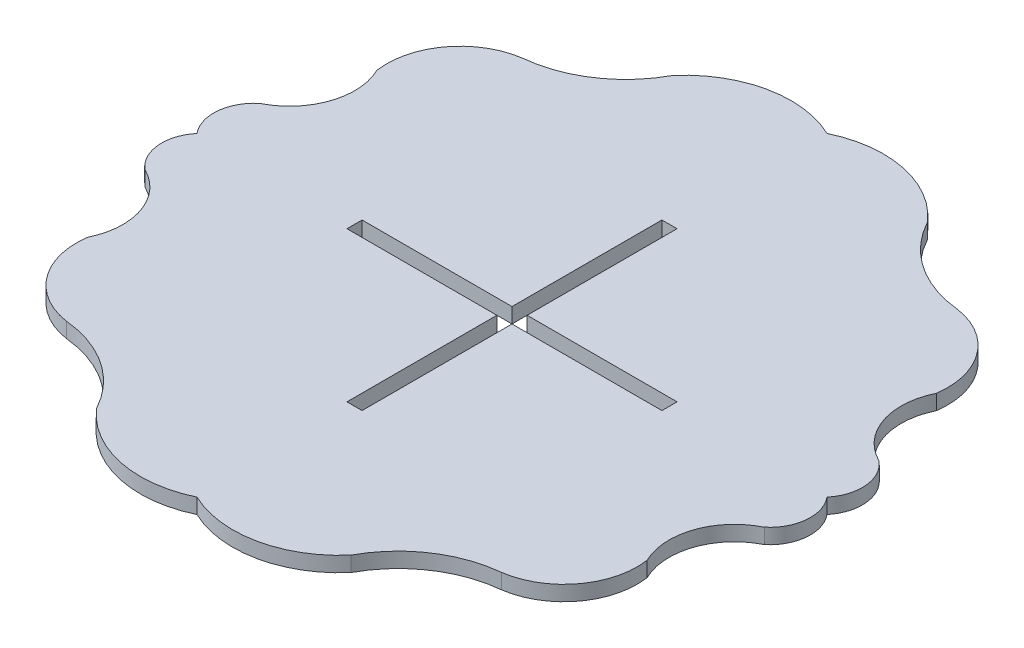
ISO-10303-21;
HEADER;
FILE_DESCRIPTION(('STEP AP214'),'2;1');
FILE_NAME('part.step','',(''),(''),'','','');
FILE_SCHEMA(('AUTOMOTIVE_DESIGN { 1 0 10303 214 1 1 1 1 }'));
ENDSEC;
DATA;
#1=APPLICATION_CONTEXT('core data for automotive mechanical design processes');
#2=APPLICATION_PROTOCOL_DEFINITION('international standard','automotive_design',2000,#1);
#3=PRODUCT_CONTEXT('',#1,'mechanical');
#4=PRODUCT('Part','Part','',(#3));
#5=PRODUCT_RELATED_PRODUCT_CATEGORY('part','',(#4));
#6=PRODUCT_DEFINITION_FORMATION('','',#4);
#7=PRODUCT_DEFINITION_CONTEXT('part definition',#1,'design');
#8=PRODUCT_DEFINITION('design','',#6,#7);
#9=PRODUCT_DEFINITION_SHAPE('','',#8);
#10=(LENGTH_UNIT() NAMED_UNIT(*) SI_UNIT(.MILLI.,.METRE.));
#11=(NAMED_UNIT(*) PLANE_ANGLE_UNIT() SI_UNIT($,.RADIAN.));
#12=(NAMED_UNIT(*) SI_UNIT($,.STERADIAN.) SOLID_ANGLE_UNIT());
#13=UNCERTAINTY_MEASURE_WITH_UNIT(LENGTH_MEASURE(1.E-05),#10,'distance_accuracy_value','');
#14=(GEOMETRIC_REPRESENTATION_CONTEXT(3) GLOBAL_UNCERTAINTY_ASSIGNED_CONTEXT((#13)) GLOBAL_UNIT_ASSIGNED_CONTEXT((#10,
#11,#12)) REPRESENTATION_CONTEXT('',''));
#15=CARTESIAN_POINT('',(0.,0.,0.));
#16=DIRECTION('',(0.,0.,1.));
#17=DIRECTION('',(1.,0.,0.));
#18=AXIS2_PLACEMENT_3D('',#15,#16,#17);
#19=CARTESIAN_POINT('',(109.076640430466,12.,-222.7049080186));
#20=DIRECTION('',(0.,-1.,0.));
#21=DIRECTION('',(0.,0.,-1.));
#22=AXIS2_PLACEMENT_3D('',#19,#20,#21);
#23=PLANE('',#22);
#24=CARTESIAN_POINT('',(36.6461026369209,12.,-173.651286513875));
#25=DIRECTION('',(0.,1.,0.));
#26=DIRECTION('',(0.,0.,-1.));
#27=AXIS2_PLACEMENT_3D('',#24,#25,#26);
#28=CIRCLE('',#27,84.6880327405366);
#29=CARTESIAN_POINT('',(101.017560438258,12.,-228.681989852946));
#30=VERTEX_POINT('',#29);
#31=CARTESIAN_POINT('',(0.,12.,-250.));
#32=VERTEX_POINT('',#31);
#33=EDGE_CURVE('E335',#30,#32,#28,.T.);
#34=ORIENTED_EDGE('',*,*,#33,.T.);
#35=CARTESIAN_POINT('',(-36.6461026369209,12.,-173.651286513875));
#36=DIRECTION('',(0.,1.,0.));
#37=DIRECTION('',(0.,0.,1.));
#38=AXIS2_PLACEMENT_3D('',#35,#36,#37);
#39=CIRCLE('',#38,84.6880327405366);
#40=CARTESIAN_POINT('',(-101.017560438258,12.,-228.681989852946));
#41=VERTEX_POINT('',#40);
#42=EDGE_CURVE('E338',#32,#41,#39,.T.);
#43=ORIENTED_EDGE('',*,*,#42,.T.);
#44=CARTESIAN_POINT('',(-181.50717822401,12.,-271.758529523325));
#45=DIRECTION('',(0.,-1.,0.));
#46=DIRECTION('',(0.,0.,-1.));
#47=AXIS2_PLACEMENT_3D('',#44,#45,#46);
#48=CIRCLE('',#47,91.2916581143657);
#49=CARTESIAN_POINT('',(-172.546852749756,12.,-180.907665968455));
#50=VERTEX_POINT('',#49);
#51=EDGE_CURVE('E341',#41,#50,#48,.T.);
#52=ORIENTED_EDGE('',*,*,#51,.T.);
#53=CARTESIAN_POINT('',(-164.277818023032,12.,-123.137833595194));
#54=DIRECTION('',(0.,1.,0.));
#55=DIRECTION('',(0.,0.,1.));
#56=AXIS2_PLACEMENT_3D('',#53,#54,#55);
#57=CIRCLE('',#56,58.358636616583);
#58=CARTESIAN_POINT('',(-222.047650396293,12.,-114.868798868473));
#59=VERTEX_POINT('',#58);
#60=EDGE_CURVE('E343',#50,#59,#57,.T.);
#61=ORIENTED_EDGE('',*,*,#60,.T.);
#62=CARTESIAN_POINT('',(-268.615396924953,12.,-92.0764276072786));
#63=DIRECTION('',(0.,-1.,0.));
#64=DIRECTION('',(0.,0.,-1.));
#65=AXIS2_PLACEMENT_3D('',#62,#63,#64);
#66=CIRCLE('',#65,51.8463808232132);
#67=CARTESIAN_POINT('',(-245.823025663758,12.,-45.5086810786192));
#68=VERTEX_POINT('',#67);
#69=EDGE_CURVE('E345',#59,#68,#66,.T.);
#70=ORIENTED_EDGE('',*,*,#69,.T.);
#71=CARTESIAN_POINT('',(-225.157172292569,12.,-20.6658533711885));
#72=DIRECTION('',(0.,1.,0.));
#73=DIRECTION('',(0.,0.,1.));
#74=AXIS2_PLACEMENT_3D('',#71,#72,#73);
#75=CIRCLE('',#74,32.3147579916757);
#76=CARTESIAN_POINT('',(-250.,12.,0.));
#77=VERTEX_POINT('',#76);
#78=EDGE_CURVE('E347',#68,#77,#75,.T.);
#79=ORIENTED_EDGE('',*,*,#78,.T.);
#80=CARTESIAN_POINT('',(-225.157172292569,12.,20.6658533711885));
#81=DIRECTION('',(0.,1.,0.));
#82=DIRECTION('',(0.,0.,-1.));
#83=AXIS2_PLACEMENT_3D('',#80,#81,#82);
#84=CIRCLE('',#83,32.3147579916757);
#85=CARTESIAN_POINT('',(-245.823025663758,12.,45.5086810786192));
#86=VERTEX_POINT('',#85);
#87=EDGE_CURVE('E349',#77,#86,#84,.T.);
#88=ORIENTED_EDGE('',*,*,#87,.T.);
#89=CARTESIAN_POINT('',(-268.615396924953,12.,92.0764276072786));
#90=DIRECTION('',(0.,-1.,0.));
#91=DIRECTION('',(0.,0.,1.));
#92=AXIS2_PLACEMENT_3D('',#89,#90,#91);
#93=CIRCLE('',#92,51.8463808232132);
#94=CARTESIAN_POINT('',(-222.047650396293,12.,114.868798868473));
#95=VERTEX_POINT('',#94);
#96=EDGE_CURVE('E351',#86,#95,#93,.T.);
#97=ORIENTED_EDGE('',*,*,#96,.T.);
#98=CARTESIAN_POINT('',(-164.277818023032,12.,123.137833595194));
#99=DIRECTION('',(0.,1.,0.));
#100=DIRECTION('',(0.,0.,-1.));
#101=AXIS2_PLACEMENT_3D('',#98,#99,#100);
#102=CIRCLE('',#101,58.358636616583);
#103=CARTESIAN_POINT('',(-172.546852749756,12.,180.907665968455));
#104=VERTEX_POINT('',#103);
#105=EDGE_CURVE('E353',#95,#104,#102,.T.);
#106=ORIENTED_EDGE('',*,*,#105,.T.);
#107=CARTESIAN_POINT('',(-181.50717822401,12.,271.758529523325));
#108=DIRECTION('',(0.,-1.,0.));
#109=DIRECTION('',(0.,0.,1.));
#110=AXIS2_PLACEMENT_3D('',#107,#108,#109);
#111=CIRCLE('',#110,91.2916581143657);
#112=CARTESIAN_POINT('',(-101.017560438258,12.,228.681989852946));
#113=VERTEX_POINT('',#112);
#114=EDGE_CURVE('E355',#104,#113,#111,.T.);
#115=ORIENTED_EDGE('',*,*,#114,.T.);
#116=CARTESIAN_POINT('',(-36.6461026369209,12.,173.651286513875));
#117=DIRECTION('',(0.,1.,0.));
#118=DIRECTION('',(0.,0.,-1.));
#119=AXIS2_PLACEMENT_3D('',#116,#117,#118);
#120=CIRCLE('',#119,84.6880327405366);
#121=CARTESIAN_POINT('',(0.,12.,250.));
#122=VERTEX_POINT('',#121);
#123=EDGE_CURVE('E357',#113,#122,#120,.T.);
#124=ORIENTED_EDGE('',*,*,#123,.T.);
#125=CARTESIAN_POINT('',(36.6461026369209,12.,173.651286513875));
#126=DIRECTION('',(0.,1.,0.));
#127=DIRECTION('',(0.,0.,1.));
#128=AXIS2_PLACEMENT_3D('',#125,#126,#127);
#129=CIRCLE('',#128,84.6880327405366);
#130=CARTESIAN_POINT('',(101.017560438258,12.,228.681989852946));
#131=VERTEX_POINT('',#130);
#132=EDGE_CURVE('E359',#122,#131,#129,.T.);
#133=ORIENTED_EDGE('',*,*,#132,.T.);
#134=CARTESIAN_POINT('',(181.50717822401,12.,271.758529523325));
#135=DIRECTION('',(0.,-1.,0.));
#136=DIRECTION('',(0.,0.,-1.));
#137=AXIS2_PLACEMENT_3D('',#134,#135,#136);
#138=CIRCLE('',#137,91.2916581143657);
#139=CARTESIAN_POINT('',(172.546852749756,12.,180.907665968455));
#140=VERTEX_POINT('',#139);
#141=EDGE_CURVE('E361',#131,#140,#138,.T.);
#142=ORIENTED_EDGE('',*,*,#141,.T.);
#143=CARTESIAN_POINT('',(164.277818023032,12.,123.137833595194));
#144=DIRECTION('',(0.,1.,0.));
#145=DIRECTION('',(0.,0.,1.));
#146=AXIS2_PLACEMENT_3D('',#143,#144,#145);
#147=CIRCLE('',#146,58.358636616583);
#148=CARTESIAN_POINT('',(222.047650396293,12.,114.868798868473));
#149=VERTEX_POINT('',#148);
#150=EDGE_CURVE('E363',#140,#149,#147,.T.);
#151=ORIENTED_EDGE('',*,*,#150,.T.);
#152=CARTESIAN_POINT('',(268.615396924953,12.,92.0764276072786));
#153=DIRECTION('',(0.,-1.,0.));
#154=DIRECTION('',(0.,0.,-1.));
#155=AXIS2_PLACEMENT_3D('',#152,#153,#154);
#156=CIRCLE('',#155,51.8463808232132);
#157=CARTESIAN_POINT('',(245.823025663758,12.,45.5086810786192));
#158=VERTEX_POINT('',#157);
#159=EDGE_CURVE('E365',#149,#158,#156,.T.);
#160=ORIENTED_EDGE('',*,*,#159,.T.);
#161=CARTESIAN_POINT('',(225.157172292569,12.,20.6658533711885));
#162=DIRECTION('',(0.,1.,0.));
#163=DIRECTION('',(0.,0.,1.));
#164=AXIS2_PLACEMENT_3D('',#161,#162,#163);
#165=CIRCLE('',#164,32.3147579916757);
#166=CARTESIAN_POINT('',(250.,12.,0.));
#167=VERTEX_POINT('',#166);
#168=EDGE_CURVE('E367',#158,#167,#165,.T.);
#169=ORIENTED_EDGE('',*,*,#168,.T.);
#170=CARTESIAN_POINT('',(225.157172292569,12.,-20.6658533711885));
#171=DIRECTION('',(0.,1.,0.));
#172=DIRECTION('',(0.,0.,-1.));
#173=AXIS2_PLACEMENT_3D('',#170,#171,#172);
#174=CIRCLE('',#173,32.3147579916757);
#175=CARTESIAN_POINT('',(245.823025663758,12.,-45.5086810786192));
#176=VERTEX_POINT('',#175);
#177=EDGE_CURVE('E369',#167,#176,#174,.T.);
#178=ORIENTED_EDGE('',*,*,#177,.T.);
#179=CARTESIAN_POINT('',(268.615396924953,12.,-92.0764276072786));
#180=DIRECTION('',(0.,-1.,0.));
#181=DIRECTION('',(0.,0.,1.));
#182=AXIS2_PLACEMENT_3D('',#179,#180,#181);
#183=CIRCLE('',#182,51.8463808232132);
#184=CARTESIAN_POINT('',(222.047650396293,12.,-114.868798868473));
#185=VERTEX_POINT('',#184);
#186=EDGE_CURVE('E371',#176,#185,#183,.T.);
#187=ORIENTED_EDGE('',*,*,#186,.T.);
#188=CARTESIAN_POINT('',(164.277818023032,12.,-123.137833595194));
#189=DIRECTION('',(0.,1.,0.));
#190=DIRECTION('',(0.,0.,-1.));
#191=AXIS2_PLACEMENT_3D('',#188,#189,#190);
#192=CIRCLE('',#191,58.358636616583);
#193=CARTESIAN_POINT('',(172.546852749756,12.,-180.907665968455));
#194=VERTEX_POINT('',#193);
#195=EDGE_CURVE('E373',#185,#194,#192,.T.);
#196=ORIENTED_EDGE('',*,*,#195,.T.);
#197=CARTESIAN_POINT('',(181.50717822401,12.,-271.758529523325));
#198=DIRECTION('',(0.,-1.,0.));
#199=DIRECTION('',(0.,0.,1.));
#200=AXIS2_PLACEMENT_3D('',#197,#198,#199);
#201=CIRCLE('',#200,91.2916581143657);
#202=EDGE_CURVE('E375',#194,#30,#201,.T.);
#203=ORIENTED_EDGE('',*,*,#202,.T.);
#204=EDGE_LOOP('',(#34,#43,#52,#61,#70,#79,#88,#97,#106,#115,#124,#133,#142,#151,#160,#169,#178,
#187,#196,#203));
#205=FACE_BOUND('',#204,.T.);
#206=DIRECTION('',(0.,0.,1.));
#207=VECTOR('',#206,1.);
#208=CARTESIAN_POINT('',(-5.99999999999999,12.,-125.));
#209=LINE('',#208,#207);
#210=CARTESIAN_POINT('',(-5.99999999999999,12.,-125.));
#211=VERTEX_POINT('',#210);
#212=CARTESIAN_POINT('',(-5.99999999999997,12.,-6.));
#213=VERTEX_POINT('',#212);
#214=EDGE_CURVE('E242',#211,#213,#209,.T.);
#215=ORIENTED_EDGE('',*,*,#214,.F.);
#216=DIRECTION('',(-1.,0.,0.));
#217=VECTOR('',#216,1.);
#218=CARTESIAN_POINT('',(-5.99999999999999,12.,-125.));
#219=LINE('',#218,#217);
#220=CARTESIAN_POINT('',(6.00000000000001,12.,-125.));
#221=VERTEX_POINT('',#220);
#222=EDGE_CURVE('E283',#221,#211,#219,.T.);
#223=ORIENTED_EDGE('',*,*,#222,.F.);
#224=DIRECTION('',(0.,0.,-1.));
#225=VECTOR('',#224,1.);
#226=CARTESIAN_POINT('',(6.00000000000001,12.,-125.));
#227=LINE('',#226,#225);
#228=CARTESIAN_POINT('',(6.00000000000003,12.,-6.));
#229=VERTEX_POINT('',#228);
#230=EDGE_CURVE('E281',#229,#221,#227,.T.);
#231=ORIENTED_EDGE('',*,*,#230,.F.);
#232=DIRECTION('',(-1.,0.,0.));
#233=VECTOR('',#232,1.);
#234=CARTESIAN_POINT('',(6.00000000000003,12.,-6.));
#235=LINE('',#234,#233);
#236=CARTESIAN_POINT('',(125.,12.,-6.));
#237=VERTEX_POINT('',#236);
#238=EDGE_CURVE('E279',#237,#229,#235,.T.);
#239=ORIENTED_EDGE('',*,*,#238,.F.);
#240=DIRECTION('',(0.,0.,-1.));
#241=VECTOR('',#240,1.);
#242=CARTESIAN_POINT('',(125.,12.,-6.));
#243=LINE('',#242,#241);
#244=CARTESIAN_POINT('',(125.,12.,6.));
#245=VERTEX_POINT('',#244);
#246=EDGE_CURVE('E277',#245,#237,#243,.T.);
#247=ORIENTED_EDGE('',*,*,#246,.F.);
#248=DIRECTION('',(1.,0.,0.));
#249=VECTOR('',#248,1.);
#250=CARTESIAN_POINT('',(6.00000000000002,12.,6.));
#251=LINE('',#250,#249);
#252=CARTESIAN_POINT('',(6.00000000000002,12.,6.));
#253=VERTEX_POINT('',#252);
#254=EDGE_CURVE('E275',#253,#245,#251,.T.);
#255=ORIENTED_EDGE('',*,*,#254,.F.);
#256=DIRECTION('',(0.,0.,-1.));
#257=VECTOR('',#256,1.);
#258=CARTESIAN_POINT('',(6.00000000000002,12.,6.));
#259=LINE('',#258,#257);
#260=CARTESIAN_POINT('',(6.00000000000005,12.,125.));
#261=VERTEX_POINT('',#260);
#262=EDGE_CURVE('E273',#261,#253,#259,.T.);
#263=ORIENTED_EDGE('',*,*,#262,.F.);
#264=DIRECTION('',(1.,0.,0.));
#265=VECTOR('',#264,1.);
#266=CARTESIAN_POINT('',(-5.99999999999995,12.,125.));
#267=LINE('',#266,#265);
#268=CARTESIAN_POINT('',(-5.99999999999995,12.,125.));
#269=VERTEX_POINT('',#268);
#270=EDGE_CURVE('E271',#269,#261,#267,.T.);
#271=ORIENTED_EDGE('',*,*,#270,.F.);
#272=DIRECTION('',(0.,0.,1.));
#273=VECTOR('',#272,1.);
#274=CARTESIAN_POINT('',(-5.99999999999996,12.,6.));
#275=LINE('',#274,#273);
#276=CARTESIAN_POINT('',(-5.99999999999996,12.,6.));
#277=VERTEX_POINT('',#276);
#278=EDGE_CURVE('E269',#277,#269,#275,.T.);
#279=ORIENTED_EDGE('',*,*,#278,.F.);
#280=DIRECTION('',(1.,0.,0.));
#281=VECTOR('',#280,1.);
#282=CARTESIAN_POINT('',(-125.,12.,6.));
#283=LINE('',#282,#281);
#284=CARTESIAN_POINT('',(-125.,12.,6.));
#285=VERTEX_POINT('',#284);
#286=EDGE_CURVE('E265',#285,#277,#283,.T.);
#287=ORIENTED_EDGE('',*,*,#286,.F.);
#288=DIRECTION('',(0.,0.,1.));
#289=VECTOR('',#288,1.);
#290=CARTESIAN_POINT('',(-125.,12.,-6.));
#291=LINE('',#290,#289);
#292=CARTESIAN_POINT('',(-125.,12.,-6.));
#293=VERTEX_POINT('',#292);
#294=EDGE_CURVE('E263',#293,#285,#291,.T.);
#295=ORIENTED_EDGE('',*,*,#294,.F.);
#296=DIRECTION('',(-1.,0.,0.));
#297=VECTOR('',#296,1.);
#298=CARTESIAN_POINT('',(-125.,12.,-6.));
#299=LINE('',#298,#297);
#300=EDGE_CURVE('E250',#213,#293,#299,.T.);
#301=ORIENTED_EDGE('',*,*,#300,.F.);
#302=EDGE_LOOP('',(#215,#223,#231,#239,#247,#255,#263,#271,#279,#287,#295,#301));
#303=FACE_BOUND('',#302,.T.);
#304=ADVANCED_FACE('F33',(#205,#303),#23,.F.);
#305=CARTESIAN_POINT('',(109.076640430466,0.,-222.7049080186));
#306=DIRECTION('',(0.,-1.,0.));
#307=DIRECTION('',(0.,0.,-1.));
#308=AXIS2_PLACEMENT_3D('',#305,#306,#307);
#309=PLANE('',#308);
#310=CARTESIAN_POINT('',(36.6461026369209,0.,-173.651286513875));
#311=DIRECTION('',(0.,1.,0.));
#312=DIRECTION('',(0.,0.,-1.));
#313=AXIS2_PLACEMENT_3D('',#310,#311,#312);
#314=CIRCLE('',#313,84.6880327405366);
#315=CARTESIAN_POINT('',(101.017560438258,0.,-228.681989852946));
#316=VERTEX_POINT('',#315);
#317=CARTESIAN_POINT('',(0.,0.,-250.));
#318=VERTEX_POINT('',#317);
#319=EDGE_CURVE('E258',#316,#318,#314,.T.);
#320=ORIENTED_EDGE('',*,*,#319,.F.);
#321=CARTESIAN_POINT('',(181.50717822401,0.,-271.758529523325));
#322=DIRECTION('',(0.,-1.,0.));
#323=DIRECTION('',(0.,0.,1.));
#324=AXIS2_PLACEMENT_3D('',#321,#322,#323);
#325=CIRCLE('',#324,91.2916581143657);
#326=CARTESIAN_POINT('',(172.546852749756,0.,-180.907665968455));
#327=VERTEX_POINT('',#326);
#328=EDGE_CURVE('E339',#327,#316,#325,.T.);
#329=ORIENTED_EDGE('',*,*,#328,.F.);
#330=CARTESIAN_POINT('',(164.277818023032,0.,-123.137833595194));
#331=DIRECTION('',(0.,1.,0.));
#332=DIRECTION('',(0.,0.,-1.));
#333=AXIS2_PLACEMENT_3D('',#330,#331,#332);
#334=CIRCLE('',#333,58.358636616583);
#335=CARTESIAN_POINT('',(222.047650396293,0.,-114.868798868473));
#336=VERTEX_POINT('',#335);
#337=EDGE_CURVE('E414',#336,#327,#334,.T.);
#338=ORIENTED_EDGE('',*,*,#337,.F.);
#339=CARTESIAN_POINT('',(268.615396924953,0.,-92.0764276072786));
#340=DIRECTION('',(0.,-1.,0.));
#341=DIRECTION('',(0.,0.,1.));
#342=AXIS2_PLACEMENT_3D('',#339,#340,#341);
#343=CIRCLE('',#342,51.8463808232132);
#344=CARTESIAN_POINT('',(245.823025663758,0.,-45.5086810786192));
#345=VERTEX_POINT('',#344);
#346=EDGE_CURVE('E412',#345,#336,#343,.T.);
#347=ORIENTED_EDGE('',*,*,#346,.F.);
#348=CARTESIAN_POINT('',(225.157172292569,0.,-20.6658533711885));
#349=DIRECTION('',(0.,1.,0.));
#350=DIRECTION('',(0.,0.,-1.));
#351=AXIS2_PLACEMENT_3D('',#348,#349,#350);
#352=CIRCLE('',#351,32.3147579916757);
#353=CARTESIAN_POINT('',(250.,0.,0.));
#354=VERTEX_POINT('',#353);
#355=EDGE_CURVE('E410',#354,#345,#352,.T.);
#356=ORIENTED_EDGE('',*,*,#355,.F.);
#357=CARTESIAN_POINT('',(225.157172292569,0.,20.6658533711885));
#358=DIRECTION('',(0.,1.,0.));
#359=DIRECTION('',(0.,0.,1.));
#360=AXIS2_PLACEMENT_3D('',#357,#358,#359);
#361=CIRCLE('',#360,32.3147579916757);
#362=CARTESIAN_POINT('',(245.823025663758,0.,45.5086810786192));
#363=VERTEX_POINT('',#362);
#364=EDGE_CURVE('E408',#363,#354,#361,.T.);
#365=ORIENTED_EDGE('',*,*,#364,.F.);
#366=CARTESIAN_POINT('',(268.615396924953,0.,92.0764276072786));
#367=DIRECTION('',(0.,-1.,0.));
#368=DIRECTION('',(0.,0.,-1.));
#369=AXIS2_PLACEMENT_3D('',#366,#367,#368);
#370=CIRCLE('',#369,51.8463808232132);
#371=CARTESIAN_POINT('',(222.047650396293,0.,114.868798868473));
#372=VERTEX_POINT('',#371);
#373=EDGE_CURVE('E406',#372,#363,#370,.T.);
#374=ORIENTED_EDGE('',*,*,#373,.F.);
#375=CARTESIAN_POINT('',(164.277818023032,0.,123.137833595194));
#376=DIRECTION('',(0.,1.,0.));
#377=DIRECTION('',(0.,0.,1.));
#378=AXIS2_PLACEMENT_3D('',#375,#376,#377);
#379=CIRCLE('',#378,58.358636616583);
#380=CARTESIAN_POINT('',(172.546852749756,0.,180.907665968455));
#381=VERTEX_POINT('',#380);
#382=EDGE_CURVE('E404',#381,#372,#379,.T.);
#383=ORIENTED_EDGE('',*,*,#382,.F.);
#384=CARTESIAN_POINT('',(181.50717822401,0.,271.758529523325));
#385=DIRECTION('',(0.,-1.,0.));
#386=DIRECTION('',(0.,0.,-1.));
#387=AXIS2_PLACEMENT_3D('',#384,#385,#386);
#388=CIRCLE('',#387,91.2916581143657);
#389=CARTESIAN_POINT('',(101.017560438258,0.,228.681989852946));
#390=VERTEX_POINT('',#389);
#391=EDGE_CURVE('E402',#390,#381,#388,.T.);
#392=ORIENTED_EDGE('',*,*,#391,.F.);
#393=CARTESIAN_POINT('',(36.6461026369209,0.,173.651286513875));
#394=DIRECTION('',(0.,1.,0.));
#395=DIRECTION('',(0.,0.,1.));
#396=AXIS2_PLACEMENT_3D('',#393,#394,#395);
#397=CIRCLE('',#396,84.6880327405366);
#398=CARTESIAN_POINT('',(0.,0.,250.));
#399=VERTEX_POINT('',#398);
#400=EDGE_CURVE('E400',#399,#390,#397,.T.);
#401=ORIENTED_EDGE('',*,*,#400,.F.);
#402=CARTESIAN_POINT('',(-36.6461026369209,0.,173.651286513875));
#403=DIRECTION('',(0.,1.,0.));
#404=DIRECTION('',(0.,0.,-1.));
#405=AXIS2_PLACEMENT_3D('',#402,#403,#404);
#406=CIRCLE('',#405,84.6880327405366);
#407=CARTESIAN_POINT('',(-101.017560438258,0.,228.681989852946));
#408=VERTEX_POINT('',#407);
#409=EDGE_CURVE('E398',#408,#399,#406,.T.);
#410=ORIENTED_EDGE('',*,*,#409,.F.);
#411=CARTESIAN_POINT('',(-181.50717822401,0.,271.758529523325));
#412=DIRECTION('',(0.,-1.,0.));
#413=DIRECTION('',(0.,0.,1.));
#414=AXIS2_PLACEMENT_3D('',#411,#412,#413);
#415=CIRCLE('',#414,91.2916581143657);
#416=CARTESIAN_POINT('',(-172.546852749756,0.,180.907665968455));
#417=VERTEX_POINT('',#416);
#418=EDGE_CURVE('E396',#417,#408,#415,.T.);
#419=ORIENTED_EDGE('',*,*,#418,.F.);
#420=CARTESIAN_POINT('',(-164.277818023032,0.,123.137833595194));
#421=DIRECTION('',(0.,1.,0.));
#422=DIRECTION('',(0.,0.,-1.));
#423=AXIS2_PLACEMENT_3D('',#420,#421,#422);
#424=CIRCLE('',#423,58.358636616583);
#425=CARTESIAN_POINT('',(-222.047650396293,0.,114.868798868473));
#426=VERTEX_POINT('',#425);
#427=EDGE_CURVE('E394',#426,#417,#424,.T.);
#428=ORIENTED_EDGE('',*,*,#427,.F.);
#429=CARTESIAN_POINT('',(-268.615396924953,0.,92.0764276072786));
#430=DIRECTION('',(0.,-1.,0.));
#431=DIRECTION('',(0.,0.,1.));
#432=AXIS2_PLACEMENT_3D('',#429,#430,#431);
#433=CIRCLE('',#432,51.8463808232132);
#434=CARTESIAN_POINT('',(-245.823025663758,0.,45.5086810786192));
#435=VERTEX_POINT('',#434);
#436=EDGE_CURVE('E392',#435,#426,#433,.T.);
#437=ORIENTED_EDGE('',*,*,#436,.F.);
#438=CARTESIAN_POINT('',(-225.157172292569,0.,20.6658533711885));
#439=DIRECTION('',(0.,1.,0.));
#440=DIRECTION('',(0.,0.,-1.));
#441=AXIS2_PLACEMENT_3D('',#438,#439,#440);
#442=CIRCLE('',#441,32.3147579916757);
#443=CARTESIAN_POINT('',(-250.,0.,0.));
#444=VERTEX_POINT('',#443);
#445=EDGE_CURVE('E390',#444,#435,#442,.T.);
#446=ORIENTED_EDGE('',*,*,#445,.F.);
#447=CARTESIAN_POINT('',(-225.157172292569,0.,-20.6658533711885));
#448=DIRECTION('',(0.,1.,0.));
#449=DIRECTION('',(0.,0.,1.));
#450=AXIS2_PLACEMENT_3D('',#447,#448,#449);
#451=CIRCLE('',#450,32.3147579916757);
#452=CARTESIAN_POINT('',(-245.823025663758,0.,-45.5086810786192));
#453=VERTEX_POINT('',#452);
#454=EDGE_CURVE('E388',#453,#444,#451,.T.);
#455=ORIENTED_EDGE('',*,*,#454,.F.);
#456=CARTESIAN_POINT('',(-268.615396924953,0.,-92.0764276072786));
#457=DIRECTION('',(0.,-1.,0.));
#458=DIRECTION('',(0.,0.,-1.));
#459=AXIS2_PLACEMENT_3D('',#456,#457,#458);
#460=CIRCLE('',#459,51.8463808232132);
#461=CARTESIAN_POINT('',(-222.047650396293,0.,-114.868798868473));
#462=VERTEX_POINT('',#461);
#463=EDGE_CURVE('E386',#462,#453,#460,.T.);
#464=ORIENTED_EDGE('',*,*,#463,.F.);
#465=CARTESIAN_POINT('',(-164.277818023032,0.,-123.137833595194));
#466=DIRECTION('',(0.,1.,0.));
#467=DIRECTION('',(0.,0.,1.));
#468=AXIS2_PLACEMENT_3D('',#465,#466,#467);
#469=CIRCLE('',#468,58.358636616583);
#470=CARTESIAN_POINT('',(-172.546852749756,0.,-180.907665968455));
#471=VERTEX_POINT('',#470);
#472=EDGE_CURVE('E384',#471,#462,#469,.T.);
#473=ORIENTED_EDGE('',*,*,#472,.F.);
#474=CARTESIAN_POINT('',(-181.50717822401,0.,-271.758529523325));
#475=DIRECTION('',(0.,-1.,0.));
#476=DIRECTION('',(0.,0.,-1.));
#477=AXIS2_PLACEMENT_3D('',#474,#475,#476);
#478=CIRCLE('',#477,91.2916581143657);
#479=CARTESIAN_POINT('',(-101.017560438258,0.,-228.681989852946));
#480=VERTEX_POINT('',#479);
#481=EDGE_CURVE('E382',#480,#471,#478,.T.);
#482=ORIENTED_EDGE('',*,*,#481,.F.);
#483=CARTESIAN_POINT('',(-36.6461026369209,0.,-173.651286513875));
#484=DIRECTION('',(0.,1.,0.));
#485=DIRECTION('',(0.,0.,1.));
#486=AXIS2_PLACEMENT_3D('',#483,#484,#485);
#487=CIRCLE('',#486,84.6880327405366);
#488=EDGE_CURVE('E380',#318,#480,#487,.T.);
#489=ORIENTED_EDGE('',*,*,#488,.F.);
#490=EDGE_LOOP('',(#320,#329,#338,#347,#356,#365,#374,#383,#392,#401,#410,#419,#428,#437,#446,
#455,#464,#473,#482,#489));
#491=FACE_BOUND('',#490,.T.);
#492=DIRECTION('',(-1.,0.,0.));
#493=VECTOR('',#492,1.);
#494=CARTESIAN_POINT('',(-5.99999999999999,0.,-125.));
#495=LINE('',#494,#493);
#496=CARTESIAN_POINT('',(6.00000000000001,0.,-125.));
#497=VERTEX_POINT('',#496);
#498=CARTESIAN_POINT('',(-5.99999999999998,0.,-125.));
#499=VERTEX_POINT('',#498);
#500=EDGE_CURVE('E251',#497,#499,#495,.T.);
#501=ORIENTED_EDGE('',*,*,#500,.T.);
#502=DIRECTION('',(0.,0.,1.));
#503=VECTOR('',#502,1.);
#504=CARTESIAN_POINT('',(-5.99999999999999,0.,-125.));
#505=LINE('',#504,#503);
#506=CARTESIAN_POINT('',(-5.99999999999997,0.,-6.));
#507=VERTEX_POINT('',#506);
#508=EDGE_CURVE('E56',#499,#507,#505,.T.);
#509=ORIENTED_EDGE('',*,*,#508,.T.);
#510=DIRECTION('',(-1.,0.,0.));
#511=VECTOR('',#510,1.);
#512=CARTESIAN_POINT('',(-125.,0.,-6.));
#513=LINE('',#512,#511);
#514=CARTESIAN_POINT('',(-125.,0.,-6.));
#515=VERTEX_POINT('',#514);
#516=EDGE_CURVE('E257',#507,#515,#513,.T.);
#517=ORIENTED_EDGE('',*,*,#516,.T.);
#518=DIRECTION('',(0.,0.,1.));
#519=VECTOR('',#518,1.);
#520=CARTESIAN_POINT('',(-125.,0.,-6.));
#521=LINE('',#520,#519);
#522=CARTESIAN_POINT('',(-125.,0.,6.));
#523=VERTEX_POINT('',#522);
#524=EDGE_CURVE('E287',#515,#523,#521,.T.);
#525=ORIENTED_EDGE('',*,*,#524,.T.);
#526=DIRECTION('',(1.,0.,0.));
#527=VECTOR('',#526,1.);
#528=CARTESIAN_POINT('',(-125.,0.,6.));
#529=LINE('',#528,#527);
#530=CARTESIAN_POINT('',(-5.99999999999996,0.,6.));
#531=VERTEX_POINT('',#530);
#532=EDGE_CURVE('E290',#523,#531,#529,.T.);
#533=ORIENTED_EDGE('',*,*,#532,.T.);
#534=DIRECTION('',(0.,0.,1.));
#535=VECTOR('',#534,1.);
#536=CARTESIAN_POINT('',(-5.99999999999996,0.,6.));
#537=LINE('',#536,#535);
#538=CARTESIAN_POINT('',(-5.99999999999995,0.,125.));
#539=VERTEX_POINT('',#538);
#540=EDGE_CURVE('E293',#531,#539,#537,.T.);
#541=ORIENTED_EDGE('',*,*,#540,.T.);
#542=DIRECTION('',(1.,0.,0.));
#543=VECTOR('',#542,1.);
#544=CARTESIAN_POINT('',(-5.99999999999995,0.,125.));
#545=LINE('',#544,#543);
#546=CARTESIAN_POINT('',(6.00000000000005,0.,125.));
#547=VERTEX_POINT('',#546);
#548=EDGE_CURVE('E296',#539,#547,#545,.T.);
#549=ORIENTED_EDGE('',*,*,#548,.T.);
#550=DIRECTION('',(0.,0.,-1.));
#551=VECTOR('',#550,1.);
#552=CARTESIAN_POINT('',(6.00000000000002,0.,6.));
#553=LINE('',#552,#551);
#554=CARTESIAN_POINT('',(6.00000000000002,0.,6.));
#555=VERTEX_POINT('',#554);
#556=EDGE_CURVE('E299',#547,#555,#553,.T.);
#557=ORIENTED_EDGE('',*,*,#556,.T.);
#558=DIRECTION('',(1.,0.,0.));
#559=VECTOR('',#558,1.);
#560=CARTESIAN_POINT('',(6.00000000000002,0.,6.));
#561=LINE('',#560,#559);
#562=CARTESIAN_POINT('',(125.,0.,6.));
#563=VERTEX_POINT('',#562);
#564=EDGE_CURVE('E302',#555,#563,#561,.T.);
#565=ORIENTED_EDGE('',*,*,#564,.T.);
#566=DIRECTION('',(0.,0.,-1.));
#567=VECTOR('',#566,1.);
#568=CARTESIAN_POINT('',(125.,0.,-6.));
#569=LINE('',#568,#567);
#570=CARTESIAN_POINT('',(125.,0.,-6.));
#571=VERTEX_POINT('',#570);
#572=EDGE_CURVE('E305',#563,#571,#569,.T.);
#573=ORIENTED_EDGE('',*,*,#572,.T.);
#574=DIRECTION('',(-1.,0.,0.));
#575=VECTOR('',#574,1.);
#576=CARTESIAN_POINT('',(6.00000000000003,0.,-6.));
#577=LINE('',#576,#575);
#578=CARTESIAN_POINT('',(6.00000000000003,0.,-6.));
#579=VERTEX_POINT('',#578);
#580=EDGE_CURVE('E308',#571,#579,#577,.T.);
#581=ORIENTED_EDGE('',*,*,#580,.T.);
#582=DIRECTION('',(0.,0.,-1.));
#583=VECTOR('',#582,1.);
#584=CARTESIAN_POINT('',(6.00000000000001,0.,-125.));
#585=LINE('',#584,#583);
#586=EDGE_CURVE('E311',#579,#497,#585,.T.);
#587=ORIENTED_EDGE('',*,*,#586,.T.);
#588=EDGE_LOOP('',(#501,#509,#517,#525,#533,#541,#549,#557,#565,#573,#581,#587));
#589=FACE_BOUND('',#588,.T.);
#590=ADVANCED_FACE('F480',(#491,#589),#309,.T.);
#591=CARTESIAN_POINT('',(36.6461026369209,12.,-173.651286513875));
#592=DIRECTION('',(0.,-1.,0.));
#593=DIRECTION('',(0.,0.,-1.));
#594=AXIS2_PLACEMENT_3D('',#591,#592,#593);
#595=CYLINDRICAL_SURFACE('',#594,84.6880327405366);
#596=ORIENTED_EDGE('',*,*,#319,.T.);
#597=DIRECTION('',(0.,-1.,0.));
#598=VECTOR('',#597,1.);
#599=CARTESIAN_POINT('',(0.,12.,-250.));
#600=LINE('',#599,#598);
#601=EDGE_CURVE('E11',#32,#318,#600,.T.);
#602=ORIENTED_EDGE('',*,*,#601,.F.);
#603=ORIENTED_EDGE('',*,*,#33,.F.);
#604=DIRECTION('',(0.,-1.,0.));
#605=VECTOR('',#604,1.);
#606=CARTESIAN_POINT('',(101.017560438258,12.,-228.681989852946));
#607=LINE('',#606,#605);
#608=EDGE_CURVE('E377',#30,#316,#607,.T.);
#609=ORIENTED_EDGE('',*,*,#608,.T.);
#610=EDGE_LOOP('',(#596,#602,#603,#609));
#611=FACE_BOUND('',#610,.T.);
#612=ADVANCED_FACE('F35',(#611),#595,.T.);
#613=CARTESIAN_POINT('',(-36.6461026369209,12.,-173.651286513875));
#614=DIRECTION('',(0.,-1.,0.));
#615=DIRECTION('',(0.,0.,-1.));
#616=AXIS2_PLACEMENT_3D('',#613,#614,#615);
#617=CYLINDRICAL_SURFACE('',#616,84.6880327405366);
#618=ORIENTED_EDGE('',*,*,#488,.T.);
#619=DIRECTION('',(0.,-1.,0.));
#620=VECTOR('',#619,1.);
#621=CARTESIAN_POINT('',(-101.017560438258,12.,-228.681989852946));
#622=LINE('',#621,#620);
#623=EDGE_CURVE('E41',#41,#480,#622,.T.);
#624=ORIENTED_EDGE('',*,*,#623,.F.);
#625=ORIENTED_EDGE('',*,*,#42,.F.);
#626=ORIENTED_EDGE('',*,*,#601,.T.);
#627=EDGE_LOOP('',(#618,#624,#625,#626));
#628=FACE_BOUND('',#627,.T.);
#629=ADVANCED_FACE('F497',(#628),#617,.T.);
#630=CARTESIAN_POINT('',(-181.50717822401,12.,-271.758529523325));
#631=DIRECTION('',(0.,-1.,0.));
#632=DIRECTION('',(0.,0.,-1.));
#633=AXIS2_PLACEMENT_3D('',#630,#631,#632);
#634=CYLINDRICAL_SURFACE('',#633,91.2916581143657);
#635=ORIENTED_EDGE('',*,*,#481,.T.);
#636=DIRECTION('',(0.,-1.,0.));
#637=VECTOR('',#636,1.);
#638=CARTESIAN_POINT('',(-172.546852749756,12.,-180.907665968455));
#639=LINE('',#638,#637);
#640=EDGE_CURVE('E467',#50,#471,#639,.T.);
#641=ORIENTED_EDGE('',*,*,#640,.F.);
#642=ORIENTED_EDGE('',*,*,#51,.F.);
#643=ORIENTED_EDGE('',*,*,#623,.T.);
#644=EDGE_LOOP('',(#635,#641,#642,#643));
#645=FACE_BOUND('',#644,.T.);
#646=ADVANCED_FACE('F474',(#645),#634,.F.);
#647=CARTESIAN_POINT('',(-164.277818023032,12.,-123.137833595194));
#648=DIRECTION('',(0.,-1.,0.));
#649=DIRECTION('',(0.,0.,-1.));
#650=AXIS2_PLACEMENT_3D('',#647,#648,#649);
#651=CYLINDRICAL_SURFACE('',#650,58.358636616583);
#652=ORIENTED_EDGE('',*,*,#472,.T.);
#653=DIRECTION('',(0.,-1.,0.));
#654=VECTOR('',#653,1.);
#655=CARTESIAN_POINT('',(-222.047650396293,12.,-114.868798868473));
#656=LINE('',#655,#654);
#657=EDGE_CURVE('E464',#59,#462,#656,.T.);
#658=ORIENTED_EDGE('',*,*,#657,.F.);
#659=ORIENTED_EDGE('',*,*,#60,.F.);
#660=ORIENTED_EDGE('',*,*,#640,.T.);
#661=EDGE_LOOP('',(#652,#658,#659,#660));
#662=FACE_BOUND('',#661,.T.);
#663=ADVANCED_FACE('F486',(#662),#651,.T.);
#664=CARTESIAN_POINT('',(-268.615396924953,12.,-92.0764276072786));
#665=DIRECTION('',(0.,-1.,0.));
#666=DIRECTION('',(0.,0.,-1.));
#667=AXIS2_PLACEMENT_3D('',#664,#665,#666);
#668=CYLINDRICAL_SURFACE('',#667,51.8463808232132);
#669=ORIENTED_EDGE('',*,*,#463,.T.);
#670=DIRECTION('',(0.,-1.,0.));
#671=VECTOR('',#670,1.);
#672=CARTESIAN_POINT('',(-245.823025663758,12.,-45.5086810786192));
#673=LINE('',#672,#671);
#674=EDGE_CURVE('E461',#68,#453,#673,.T.);
#675=ORIENTED_EDGE('',*,*,#674,.F.);
#676=ORIENTED_EDGE('',*,*,#69,.F.);
#677=ORIENTED_EDGE('',*,*,#657,.T.);
#678=EDGE_LOOP('',(#669,#675,#676,#677));
#679=FACE_BOUND('',#678,.T.);
#680=ADVANCED_FACE('F490',(#679),#668,.F.);
#681=CARTESIAN_POINT('',(-225.157172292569,12.,-20.6658533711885));
#682=DIRECTION('',(0.,-1.,0.));
#683=DIRECTION('',(0.,0.,-1.));
#684=AXIS2_PLACEMENT_3D('',#681,#682,#683);
#685=CYLINDRICAL_SURFACE('',#684,32.3147579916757);
#686=ORIENTED_EDGE('',*,*,#454,.T.);
#687=DIRECTION('',(0.,-1.,0.));
#688=VECTOR('',#687,1.);
#689=CARTESIAN_POINT('',(-250.,12.,0.));
#690=LINE('',#689,#688);
#691=EDGE_CURVE('E458',#77,#444,#690,.T.);
#692=ORIENTED_EDGE('',*,*,#691,.F.);
#693=ORIENTED_EDGE('',*,*,#78,.F.);
#694=ORIENTED_EDGE('',*,*,#674,.T.);
#695=EDGE_LOOP('',(#686,#692,#693,#694));
#696=FACE_BOUND('',#695,.T.);
#697=ADVANCED_FACE('F570',(#696),#685,.T.);
#698=CARTESIAN_POINT('',(-225.157172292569,12.,20.6658533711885));
#699=DIRECTION('',(0.,-1.,0.));
#700=DIRECTION('',(0.,0.,-1.));
#701=AXIS2_PLACEMENT_3D('',#698,#699,#700);
#702=CYLINDRICAL_SURFACE('',#701,32.3147579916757);
#703=ORIENTED_EDGE('',*,*,#445,.T.);
#704=DIRECTION('',(0.,-1.,0.));
#705=VECTOR('',#704,1.);
#706=CARTESIAN_POINT('',(-245.823025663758,12.,45.5086810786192));
#707=LINE('',#706,#705);
#708=EDGE_CURVE('E455',#86,#435,#707,.T.);
#709=ORIENTED_EDGE('',*,*,#708,.F.);
#710=ORIENTED_EDGE('',*,*,#87,.F.);
#711=ORIENTED_EDGE('',*,*,#691,.T.);
#712=EDGE_LOOP('',(#703,#709,#710,#711));
#713=FACE_BOUND('',#712,.T.);
#714=ADVANCED_FACE('F568',(#713),#702,.T.);
#715=CARTESIAN_POINT('',(-268.615396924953,12.,92.0764276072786));
#716=DIRECTION('',(0.,-1.,0.));
#717=DIRECTION('',(0.,0.,-1.));
#718=AXIS2_PLACEMENT_3D('',#715,#716,#717);
#719=CYLINDRICAL_SURFACE('',#718,51.8463808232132);
#720=ORIENTED_EDGE('',*,*,#436,.T.);
#721=DIRECTION('',(0.,-1.,0.));
#722=VECTOR('',#721,1.);
#723=CARTESIAN_POINT('',(-222.047650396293,12.,114.868798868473));
#724=LINE('',#723,#722);
#725=EDGE_CURVE('E452',#95,#426,#724,.T.);
#726=ORIENTED_EDGE('',*,*,#725,.F.);
#727=ORIENTED_EDGE('',*,*,#96,.F.);
#728=ORIENTED_EDGE('',*,*,#708,.T.);
#729=EDGE_LOOP('',(#720,#726,#727,#728));
#730=FACE_BOUND('',#729,.T.);
#731=ADVANCED_FACE('F563',(#730),#719,.F.);
#732=CARTESIAN_POINT('',(-164.277818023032,12.,123.137833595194));
#733=DIRECTION('',(0.,-1.,0.));
#734=DIRECTION('',(0.,0.,-1.));
#735=AXIS2_PLACEMENT_3D('',#732,#733,#734);
#736=CYLINDRICAL_SURFACE('',#735,58.358636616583);
#737=ORIENTED_EDGE('',*,*,#427,.T.);
#738=DIRECTION('',(0.,-1.,0.));
#739=VECTOR('',#738,1.);
#740=CARTESIAN_POINT('',(-172.546852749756,12.,180.907665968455));
#741=LINE('',#740,#739);
#742=EDGE_CURVE('E449',#104,#417,#741,.T.);
#743=ORIENTED_EDGE('',*,*,#742,.F.);
#744=ORIENTED_EDGE('',*,*,#105,.F.);
#745=ORIENTED_EDGE('',*,*,#725,.T.);
#746=EDGE_LOOP('',(#737,#743,#744,#745));
#747=FACE_BOUND('',#746,.T.);
#748=ADVANCED_FACE('F558',(#747),#736,.T.);
#749=CARTESIAN_POINT('',(-181.50717822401,12.,271.758529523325));
#750=DIRECTION('',(0.,-1.,0.));
#751=DIRECTION('',(0.,0.,-1.));
#752=AXIS2_PLACEMENT_3D('',#749,#750,#751);
#753=CYLINDRICAL_SURFACE('',#752,91.2916581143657);
#754=ORIENTED_EDGE('',*,*,#418,.T.);
#755=DIRECTION('',(0.,-1.,0.));
#756=VECTOR('',#755,1.);
#757=CARTESIAN_POINT('',(-101.017560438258,12.,228.681989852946));
#758=LINE('',#757,#756);
#759=EDGE_CURVE('E446',#113,#408,#758,.T.);
#760=ORIENTED_EDGE('',*,*,#759,.F.);
#761=ORIENTED_EDGE('',*,*,#114,.F.);
#762=ORIENTED_EDGE('',*,*,#742,.T.);
#763=EDGE_LOOP('',(#754,#760,#761,#762));
#764=FACE_BOUND('',#763,.T.);
#765=ADVANCED_FACE('F554',(#764),#753,.F.);
#766=CARTESIAN_POINT('',(-36.6461026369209,12.,173.651286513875));
#767=DIRECTION('',(0.,-1.,0.));
#768=DIRECTION('',(0.,0.,-1.));
#769=AXIS2_PLACEMENT_3D('',#766,#767,#768);
#770=CYLINDRICAL_SURFACE('',#769,84.6880327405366);
#771=ORIENTED_EDGE('',*,*,#409,.T.);
#772=DIRECTION('',(0.,-1.,0.));
#773=VECTOR('',#772,1.);
#774=CARTESIAN_POINT('',(0.,12.,250.));
#775=LINE('',#774,#773);
#776=EDGE_CURVE('E443',#122,#399,#775,.T.);
#777=ORIENTED_EDGE('',*,*,#776,.F.);
#778=ORIENTED_EDGE('',*,*,#123,.F.);
#779=ORIENTED_EDGE('',*,*,#759,.T.);
#780=EDGE_LOOP('',(#771,#777,#778,#779));
#781=FACE_BOUND('',#780,.T.);
#782=ADVANCED_FACE('F549',(#781),#770,.T.);
#783=CARTESIAN_POINT('',(36.6461026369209,12.,173.651286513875));
#784=DIRECTION('',(0.,-1.,0.));
#785=DIRECTION('',(0.,0.,-1.));
#786=AXIS2_PLACEMENT_3D('',#783,#784,#785);
#787=CYLINDRICAL_SURFACE('',#786,84.6880327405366);
#788=ORIENTED_EDGE('',*,*,#400,.T.);
#789=DIRECTION('',(0.,-1.,0.));
#790=VECTOR('',#789,1.);
#791=CARTESIAN_POINT('',(101.017560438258,12.,228.681989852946));
#792=LINE('',#791,#790);
#793=EDGE_CURVE('E440',#131,#390,#792,.T.);
#794=ORIENTED_EDGE('',*,*,#793,.F.);
#795=ORIENTED_EDGE('',*,*,#132,.F.);
#796=ORIENTED_EDGE('',*,*,#776,.T.);
#797=EDGE_LOOP('',(#788,#794,#795,#796));
#798=FACE_BOUND('',#797,.T.);
#799=ADVANCED_FACE('F543',(#798),#787,.T.);
#800=CARTESIAN_POINT('',(181.50717822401,12.,271.758529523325));
#801=DIRECTION('',(0.,-1.,0.));
#802=DIRECTION('',(0.,0.,-1.));
#803=AXIS2_PLACEMENT_3D('',#800,#801,#802);
#804=CYLINDRICAL_SURFACE('',#803,91.2916581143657);
#805=ORIENTED_EDGE('',*,*,#391,.T.);
#806=DIRECTION('',(0.,-1.,0.));
#807=VECTOR('',#806,1.);
#808=CARTESIAN_POINT('',(172.546852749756,12.,180.907665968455));
#809=LINE('',#808,#807);
#810=EDGE_CURVE('E437',#140,#381,#809,.T.);
#811=ORIENTED_EDGE('',*,*,#810,.F.);
#812=ORIENTED_EDGE('',*,*,#141,.F.);
#813=ORIENTED_EDGE('',*,*,#793,.T.);
#814=EDGE_LOOP('',(#805,#811,#812,#813));
#815=FACE_BOUND('',#814,.T.);
#816=ADVANCED_FACE('F539',(#815),#804,.F.);
#817=CARTESIAN_POINT('',(164.277818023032,12.,123.137833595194));
#818=DIRECTION('',(0.,-1.,0.));
#819=DIRECTION('',(0.,0.,-1.));
#820=AXIS2_PLACEMENT_3D('',#817,#818,#819);
#821=CYLINDRICAL_SURFACE('',#820,58.358636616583);
#822=ORIENTED_EDGE('',*,*,#382,.T.);
#823=DIRECTION('',(0.,-1.,0.));
#824=VECTOR('',#823,1.);
#825=CARTESIAN_POINT('',(222.047650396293,12.,114.868798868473));
#826=LINE('',#825,#824);
#827=EDGE_CURVE('E434',#149,#372,#826,.T.);
#828=ORIENTED_EDGE('',*,*,#827,.F.);
#829=ORIENTED_EDGE('',*,*,#150,.F.);
#830=ORIENTED_EDGE('',*,*,#810,.T.);
#831=EDGE_LOOP('',(#822,#828,#829,#830));
#832=FACE_BOUND('',#831,.T.);
#833=ADVANCED_FACE('F534',(#832),#821,.T.);
#834=CARTESIAN_POINT('',(268.615396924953,12.,92.0764276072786));
#835=DIRECTION('',(0.,-1.,0.));
#836=DIRECTION('',(0.,0.,-1.));
#837=AXIS2_PLACEMENT_3D('',#834,#835,#836);
#838=CYLINDRICAL_SURFACE('',#837,51.8463808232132);
#839=ORIENTED_EDGE('',*,*,#373,.T.);
#840=DIRECTION('',(0.,-1.,0.));
#841=VECTOR('',#840,1.);
#842=CARTESIAN_POINT('',(245.823025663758,12.,45.5086810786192));
#843=LINE('',#842,#841);
#844=EDGE_CURVE('E431',#158,#363,#843,.T.);
#845=ORIENTED_EDGE('',*,*,#844,.F.);
#846=ORIENTED_EDGE('',*,*,#159,.F.);
#847=ORIENTED_EDGE('',*,*,#827,.T.);
#848=EDGE_LOOP('',(#839,#845,#846,#847));
#849=FACE_BOUND('',#848,.T.);
#850=ADVANCED_FACE('F528',(#849),#838,.F.);
#851=CARTESIAN_POINT('',(225.157172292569,12.,20.6658533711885));
#852=DIRECTION('',(0.,-1.,0.));
#853=DIRECTION('',(0.,0.,-1.));
#854=AXIS2_PLACEMENT_3D('',#851,#852,#853);
#855=CYLINDRICAL_SURFACE('',#854,32.3147579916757);
#856=ORIENTED_EDGE('',*,*,#364,.T.);
#857=DIRECTION('',(0.,-1.,0.));
#858=VECTOR('',#857,1.);
#859=CARTESIAN_POINT('',(250.,12.,0.));
#860=LINE('',#859,#858);
#861=EDGE_CURVE('E428',#167,#354,#860,.T.);
#862=ORIENTED_EDGE('',*,*,#861,.F.);
#863=ORIENTED_EDGE('',*,*,#168,.F.);
#864=ORIENTED_EDGE('',*,*,#844,.T.);
#865=EDGE_LOOP('',(#856,#862,#863,#864));
#866=FACE_BOUND('',#865,.T.);
#867=ADVANCED_FACE('F524',(#866),#855,.T.);
#868=CARTESIAN_POINT('',(225.157172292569,12.,-20.6658533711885));
#869=DIRECTION('',(0.,-1.,0.));
#870=DIRECTION('',(0.,0.,-1.));
#871=AXIS2_PLACEMENT_3D('',#868,#869,#870);
#872=CYLINDRICAL_SURFACE('',#871,32.3147579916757);
#873=ORIENTED_EDGE('',*,*,#355,.T.);
#874=DIRECTION('',(0.,-1.,0.));
#875=VECTOR('',#874,1.);
#876=CARTESIAN_POINT('',(245.823025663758,12.,-45.5086810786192));
#877=LINE('',#876,#875);
#878=EDGE_CURVE('E425',#176,#345,#877,.T.);
#879=ORIENTED_EDGE('',*,*,#878,.F.);
#880=ORIENTED_EDGE('',*,*,#177,.F.);
#881=ORIENTED_EDGE('',*,*,#861,.T.);
#882=EDGE_LOOP('',(#873,#879,#880,#881));
#883=FACE_BOUND('',#882,.T.);
#884=ADVANCED_FACE('F519',(#883),#872,.T.);
#885=CARTESIAN_POINT('',(268.615396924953,12.,-92.0764276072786));
#886=DIRECTION('',(0.,-1.,0.));
#887=DIRECTION('',(0.,0.,-1.));
#888=AXIS2_PLACEMENT_3D('',#885,#886,#887);
#889=CYLINDRICAL_SURFACE('',#888,51.8463808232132);
#890=ORIENTED_EDGE('',*,*,#346,.T.);
#891=DIRECTION('',(0.,-1.,0.));
#892=VECTOR('',#891,1.);
#893=CARTESIAN_POINT('',(222.047650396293,12.,-114.868798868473));
#894=LINE('',#893,#892);
#895=EDGE_CURVE('E422',#185,#336,#894,.T.);
#896=ORIENTED_EDGE('',*,*,#895,.F.);
#897=ORIENTED_EDGE('',*,*,#186,.F.);
#898=ORIENTED_EDGE('',*,*,#878,.T.);
#899=EDGE_LOOP('',(#890,#896,#897,#898));
#900=FACE_BOUND('',#899,.T.);
#901=ADVANCED_FACE('F513',(#900),#889,.F.);
#902=CARTESIAN_POINT('',(164.277818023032,12.,-123.137833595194));
#903=DIRECTION('',(0.,-1.,0.));
#904=DIRECTION('',(0.,0.,-1.));
#905=AXIS2_PLACEMENT_3D('',#902,#903,#904);
#906=CYLINDRICAL_SURFACE('',#905,58.358636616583);
#907=ORIENTED_EDGE('',*,*,#337,.T.);
#908=DIRECTION('',(0.,-1.,0.));
#909=VECTOR('',#908,1.);
#910=CARTESIAN_POINT('',(172.546852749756,12.,-180.907665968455));
#911=LINE('',#910,#909);
#912=EDGE_CURVE('E419',#194,#327,#911,.T.);
#913=ORIENTED_EDGE('',*,*,#912,.F.);
#914=ORIENTED_EDGE('',*,*,#195,.F.);
#915=ORIENTED_EDGE('',*,*,#895,.T.);
#916=EDGE_LOOP('',(#907,#913,#914,#915));
#917=FACE_BOUND('',#916,.T.);
#918=ADVANCED_FACE('F509',(#917),#906,.T.);
#919=CARTESIAN_POINT('',(181.50717822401,12.,-271.758529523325));
#920=DIRECTION('',(0.,-1.,0.));
#921=DIRECTION('',(0.,0.,-1.));
#922=AXIS2_PLACEMENT_3D('',#919,#920,#921);
#923=CYLINDRICAL_SURFACE('',#922,91.2916581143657);
#924=ORIENTED_EDGE('',*,*,#328,.T.);
#925=ORIENTED_EDGE('',*,*,#608,.F.);
#926=ORIENTED_EDGE('',*,*,#202,.F.);
#927=ORIENTED_EDGE('',*,*,#912,.T.);
#928=EDGE_LOOP('',(#924,#925,#926,#927));
#929=FACE_BOUND('',#928,.T.);
#930=ADVANCED_FACE('F504',(#929),#923,.F.);
#931=CARTESIAN_POINT('',(-5.99999999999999,12.,-125.));
#932=DIRECTION('',(1.,0.,0.));
#933=DIRECTION('',(0.,0.,-1.));
#934=AXIS2_PLACEMENT_3D('',#931,#932,#933);
#935=PLANE('',#934);
#936=ORIENTED_EDGE('',*,*,#508,.F.);
#937=DIRECTION('',(0.,-1.,0.));
#938=VECTOR('',#937,1.);
#939=CARTESIAN_POINT('',(-5.99999999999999,12.,-125.));
#940=LINE('',#939,#938);
#941=EDGE_CURVE('E246',#211,#499,#940,.T.);
#942=ORIENTED_EDGE('',*,*,#941,.F.);
#943=ORIENTED_EDGE('',*,*,#214,.T.);
#944=DIRECTION('',(0.,-1.,0.));
#945=VECTOR('',#944,1.);
#946=CARTESIAN_POINT('',(-5.99999999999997,12.,-6.));
#947=LINE('',#946,#945);
#948=EDGE_CURVE('E245',#213,#507,#947,.T.);
#949=ORIENTED_EDGE('',*,*,#948,.T.);
#950=EDGE_LOOP('',(#936,#942,#943,#949));
#951=FACE_BOUND('',#950,.T.);
#952=ADVANCED_FACE('F244',(#951),#935,.T.);
#953=CARTESIAN_POINT('',(-125.,12.,-6.));
#954=DIRECTION('',(0.,0.,1.));
#955=DIRECTION('',(1.,0.,0.));
#956=AXIS2_PLACEMENT_3D('',#953,#954,#955);
#957=PLANE('',#956);
#958=ORIENTED_EDGE('',*,*,#516,.F.);
#959=ORIENTED_EDGE('',*,*,#948,.F.);
#960=ORIENTED_EDGE('',*,*,#300,.T.);
#961=DIRECTION('',(0.,-1.,0.));
#962=VECTOR('',#961,1.);
#963=CARTESIAN_POINT('',(-125.,12.,-6.));
#964=LINE('',#963,#962);
#965=EDGE_CURVE('E259',#293,#515,#964,.T.);
#966=ORIENTED_EDGE('',*,*,#965,.T.);
#967=EDGE_LOOP('',(#958,#959,#960,#966));
#968=FACE_BOUND('',#967,.T.);
#969=ADVANCED_FACE('F254',(#968),#957,.T.);
#970=CARTESIAN_POINT('',(-125.,12.,-6.));
#971=DIRECTION('',(1.,0.,0.));
#972=DIRECTION('',(0.,0.,-1.));
#973=AXIS2_PLACEMENT_3D('',#970,#971,#972);
#974=PLANE('',#973);
#975=ORIENTED_EDGE('',*,*,#524,.F.);
#976=ORIENTED_EDGE('',*,*,#965,.F.);
#977=ORIENTED_EDGE('',*,*,#294,.T.);
#978=DIRECTION('',(0.,-1.,0.));
#979=VECTOR('',#978,1.);
#980=CARTESIAN_POINT('',(-125.,12.,6.));
#981=LINE('',#980,#979);
#982=EDGE_CURVE('E332',#285,#523,#981,.T.);
#983=ORIENTED_EDGE('',*,*,#982,.T.);
#984=EDGE_LOOP('',(#975,#976,#977,#983));
#985=FACE_BOUND('',#984,.T.);
#986=ADVANCED_FACE('F676',(#985),#974,.T.);
#987=CARTESIAN_POINT('',(-125.,12.,6.));
#988=DIRECTION('',(0.,0.,-1.));
#989=DIRECTION('',(-1.,0.,0.));
#990=AXIS2_PLACEMENT_3D('',#987,#988,#989);
#991=PLANE('',#990);
#992=ORIENTED_EDGE('',*,*,#532,.F.);
#993=ORIENTED_EDGE('',*,*,#982,.F.);
#994=ORIENTED_EDGE('',*,*,#286,.T.);
#995=DIRECTION('',(0.,-1.,0.));
#996=VECTOR('',#995,1.);
#997=CARTESIAN_POINT('',(-5.99999999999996,12.,6.));
#998=LINE('',#997,#996);
#999=EDGE_CURVE('E330',#277,#531,#998,.T.);
#1000=ORIENTED_EDGE('',*,*,#999,.T.);
#1001=EDGE_LOOP('',(#992,#993,#994,#1000));
#1002=FACE_BOUND('',#1001,.T.);
#1003=ADVANCED_FACE('F682',(#1002),#991,.T.);
#1004=CARTESIAN_POINT('',(-5.99999999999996,12.,6.));
#1005=DIRECTION('',(1.,0.,0.));
#1006=DIRECTION('',(0.,0.,-1.));
#1007=AXIS2_PLACEMENT_3D('',#1004,#1005,#1006);
#1008=PLANE('',#1007);
#1009=ORIENTED_EDGE('',*,*,#540,.F.);
#1010=ORIENTED_EDGE('',*,*,#999,.F.);
#1011=ORIENTED_EDGE('',*,*,#278,.T.);
#1012=DIRECTION('',(0.,-1.,0.));
#1013=VECTOR('',#1012,1.);
#1014=CARTESIAN_POINT('',(-5.99999999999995,12.,125.));
#1015=LINE('',#1014,#1013);
#1016=EDGE_CURVE('E328',#269,#539,#1015,.T.);
#1017=ORIENTED_EDGE('',*,*,#1016,.T.);
#1018=EDGE_LOOP('',(#1009,#1010,#1011,#1017));
#1019=FACE_BOUND('',#1018,.T.);
#1020=ADVANCED_FACE('F690',(#1019),#1008,.T.);
#1021=CARTESIAN_POINT('',(-5.99999999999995,12.,125.));
#1022=DIRECTION('',(0.,0.,-1.));
#1023=DIRECTION('',(-1.,0.,0.));
#1024=AXIS2_PLACEMENT_3D('',#1021,#1022,#1023);
#1025=PLANE('',#1024);
#1026=ORIENTED_EDGE('',*,*,#548,.F.);
#1027=ORIENTED_EDGE('',*,*,#1016,.F.);
#1028=ORIENTED_EDGE('',*,*,#270,.T.);
#1029=DIRECTION('',(0.,-1.,0.));
#1030=VECTOR('',#1029,1.);
#1031=CARTESIAN_POINT('',(6.00000000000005,12.,125.));
#1032=LINE('',#1031,#1030);
#1033=EDGE_CURVE('E326',#261,#547,#1032,.T.);
#1034=ORIENTED_EDGE('',*,*,#1033,.T.);
#1035=EDGE_LOOP('',(#1026,#1027,#1028,#1034));
#1036=FACE_BOUND('',#1035,.T.);
#1037=ADVANCED_FACE('F698',(#1036),#1025,.T.);
#1038=CARTESIAN_POINT('',(6.00000000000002,12.,6.));
#1039=DIRECTION('',(-1.,0.,0.));
#1040=DIRECTION('',(0.,0.,1.));
#1041=AXIS2_PLACEMENT_3D('',#1038,#1039,#1040);
#1042=PLANE('',#1041);
#1043=ORIENTED_EDGE('',*,*,#556,.F.);
#1044=ORIENTED_EDGE('',*,*,#1033,.F.);
#1045=ORIENTED_EDGE('',*,*,#262,.T.);
#1046=DIRECTION('',(0.,-1.,0.));
#1047=VECTOR('',#1046,1.);
#1048=CARTESIAN_POINT('',(6.00000000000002,12.,6.));
#1049=LINE('',#1048,#1047);
#1050=EDGE_CURVE('E324',#253,#555,#1049,.T.);
#1051=ORIENTED_EDGE('',*,*,#1050,.T.);
#1052=EDGE_LOOP('',(#1043,#1044,#1045,#1051));
#1053=FACE_BOUND('',#1052,.T.);
#1054=ADVANCED_FACE('F706',(#1053),#1042,.T.);
#1055=CARTESIAN_POINT('',(6.00000000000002,12.,6.));
#1056=DIRECTION('',(0.,0.,-1.));
#1057=DIRECTION('',(-1.,0.,0.));
#1058=AXIS2_PLACEMENT_3D('',#1055,#1056,#1057);
#1059=PLANE('',#1058);
#1060=ORIENTED_EDGE('',*,*,#564,.F.);
#1061=ORIENTED_EDGE('',*,*,#1050,.F.);
#1062=ORIENTED_EDGE('',*,*,#254,.T.);
#1063=DIRECTION('',(0.,-1.,0.));
#1064=VECTOR('',#1063,1.);
#1065=CARTESIAN_POINT('',(125.,12.,6.));
#1066=LINE('',#1065,#1064);
#1067=EDGE_CURVE('E322',#245,#563,#1066,.T.);
#1068=ORIENTED_EDGE('',*,*,#1067,.T.);
#1069=EDGE_LOOP('',(#1060,#1061,#1062,#1068));
#1070=FACE_BOUND('',#1069,.T.);
#1071=ADVANCED_FACE('F714',(#1070),#1059,.T.);
#1072=CARTESIAN_POINT('',(125.,12.,-6.));
#1073=DIRECTION('',(-1.,0.,0.));
#1074=DIRECTION('',(0.,0.,1.));
#1075=AXIS2_PLACEMENT_3D('',#1072,#1073,#1074);
#1076=PLANE('',#1075);
#1077=ORIENTED_EDGE('',*,*,#572,.F.);
#1078=ORIENTED_EDGE('',*,*,#1067,.F.);
#1079=ORIENTED_EDGE('',*,*,#246,.T.);
#1080=DIRECTION('',(0.,-1.,0.));
#1081=VECTOR('',#1080,1.);
#1082=CARTESIAN_POINT('',(125.,12.,-6.));
#1083=LINE('',#1082,#1081);
#1084=EDGE_CURVE('E320',#237,#571,#1083,.T.);
#1085=ORIENTED_EDGE('',*,*,#1084,.T.);
#1086=EDGE_LOOP('',(#1077,#1078,#1079,#1085));
#1087=FACE_BOUND('',#1086,.T.);
#1088=ADVANCED_FACE('F722',(#1087),#1076,.T.);
#1089=CARTESIAN_POINT('',(6.00000000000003,12.,-6.));
#1090=DIRECTION('',(0.,0.,1.));
#1091=DIRECTION('',(1.,0.,0.));
#1092=AXIS2_PLACEMENT_3D('',#1089,#1090,#1091);
#1093=PLANE('',#1092);
#1094=ORIENTED_EDGE('',*,*,#580,.F.);
#1095=ORIENTED_EDGE('',*,*,#1084,.F.);
#1096=ORIENTED_EDGE('',*,*,#238,.T.);
#1097=DIRECTION('',(0.,-1.,0.));
#1098=VECTOR('',#1097,1.);
#1099=CARTESIAN_POINT('',(6.00000000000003,12.,-6.));
#1100=LINE('',#1099,#1098);
#1101=EDGE_CURVE('E318',#229,#579,#1100,.T.);
#1102=ORIENTED_EDGE('',*,*,#1101,.T.);
#1103=EDGE_LOOP('',(#1094,#1095,#1096,#1102));
#1104=FACE_BOUND('',#1103,.T.);
#1105=ADVANCED_FACE('F730',(#1104),#1093,.T.);
#1106=CARTESIAN_POINT('',(6.00000000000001,12.,-125.));
#1107=DIRECTION('',(-1.,0.,0.));
#1108=DIRECTION('',(0.,0.,1.));
#1109=AXIS2_PLACEMENT_3D('',#1106,#1107,#1108);
#1110=PLANE('',#1109);
#1111=ORIENTED_EDGE('',*,*,#586,.F.);
#1112=ORIENTED_EDGE('',*,*,#1101,.F.);
#1113=ORIENTED_EDGE('',*,*,#230,.T.);
#1114=DIRECTION('',(0.,-1.,0.));
#1115=VECTOR('',#1114,1.);
#1116=CARTESIAN_POINT('',(6.00000000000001,12.,-125.));
#1117=LINE('',#1116,#1115);
#1118=EDGE_CURVE('E48',#221,#497,#1117,.T.);
#1119=ORIENTED_EDGE('',*,*,#1118,.T.);
#1120=EDGE_LOOP('',(#1111,#1112,#1113,#1119));
#1121=FACE_BOUND('',#1120,.T.);
#1122=ADVANCED_FACE('F738',(#1121),#1110,.T.);
#1123=CARTESIAN_POINT('',(-5.99999999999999,12.,-125.));
#1124=DIRECTION('',(0.,0.,1.));
#1125=DIRECTION('',(1.,0.,0.));
#1126=AXIS2_PLACEMENT_3D('',#1123,#1124,#1125);
#1127=PLANE('',#1126);
#1128=ORIENTED_EDGE('',*,*,#500,.F.);
#1129=ORIENTED_EDGE('',*,*,#1118,.F.);
#1130=ORIENTED_EDGE('',*,*,#222,.T.);
#1131=ORIENTED_EDGE('',*,*,#941,.T.);
#1132=EDGE_LOOP('',(#1128,#1129,#1130,#1131));
#1133=FACE_BOUND('',#1132,.T.);
#1134=ADVANCED_FACE('F746',(#1133),#1127,.T.);
#1135=CLOSED_SHELL('',(#304,#590,#612,#629,#646,#663,#680,#697,#714,#731,#748,#765,#782,#799,
#816,#833,#850,#867,#884,#901,#918,#930,#952,#969,#986,#1003,#1020,#1037,#1054,#1071,#1088,
#1105,#1122,#1134));
#1136=MANIFOLD_SOLID_BREP('B2',#1135);
#1137=ADVANCED_BREP_SHAPE_REPRESENTATION('',(#18,#1136),#14);
#1138=SHAPE_DEFINITION_REPRESENTATION(#9,#1137);
ENDSEC;
END-ISO-10303-21;
